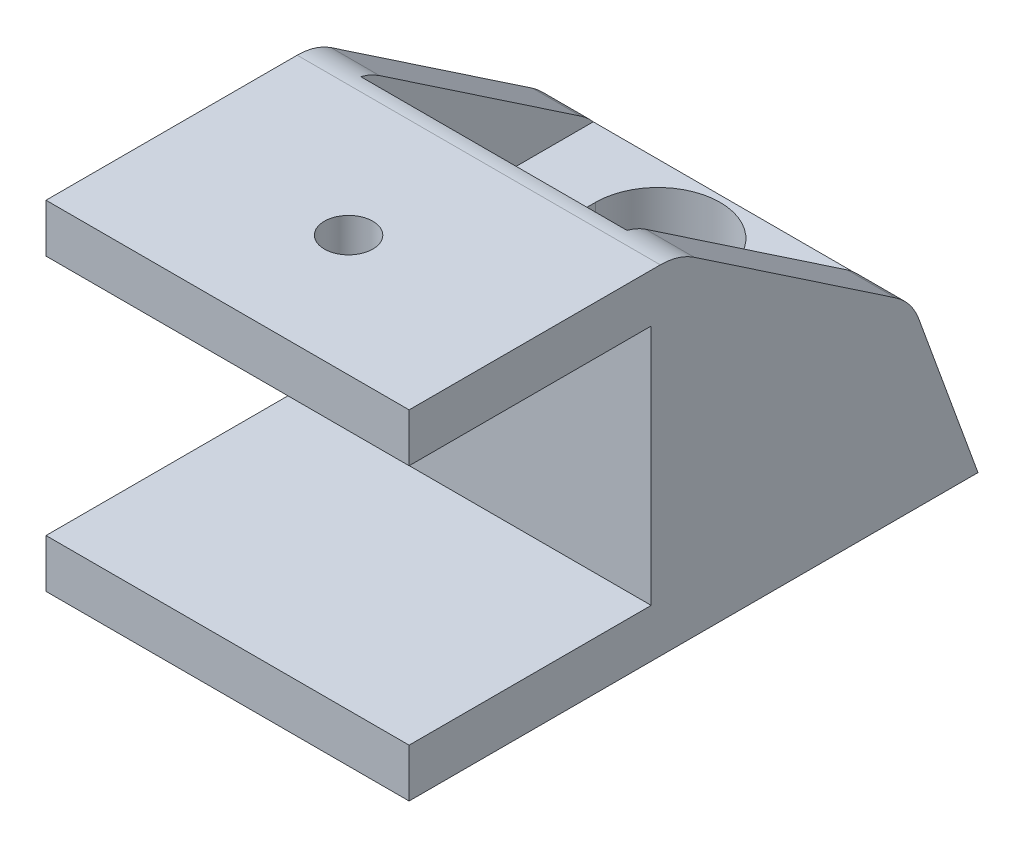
ISO-10303-21;
HEADER;
FILE_DESCRIPTION(('STEP AP214'),'2;1');
FILE_NAME('part.step','',(''),(''),'','','');
FILE_SCHEMA(('AUTOMOTIVE_DESIGN { 1 0 10303 214 1 1 1 1 }'));
ENDSEC;
DATA;
#1=APPLICATION_CONTEXT('core data for automotive mechanical design processes');
#2=APPLICATION_PROTOCOL_DEFINITION('international standard','automotive_design',2000,#1);
#3=PRODUCT_CONTEXT('',#1,'mechanical');
#4=PRODUCT('Part','Part','',(#3));
#5=PRODUCT_RELATED_PRODUCT_CATEGORY('part','',(#4));
#6=PRODUCT_DEFINITION_FORMATION('','',#4);
#7=PRODUCT_DEFINITION_CONTEXT('part definition',#1,'design');
#8=PRODUCT_DEFINITION('design','',#6,#7);
#9=PRODUCT_DEFINITION_SHAPE('','',#8);
#10=(LENGTH_UNIT() NAMED_UNIT(*) SI_UNIT(.MILLI.,.METRE.));
#11=(NAMED_UNIT(*) PLANE_ANGLE_UNIT() SI_UNIT($,.RADIAN.));
#12=(NAMED_UNIT(*) SI_UNIT($,.STERADIAN.) SOLID_ANGLE_UNIT());
#13=UNCERTAINTY_MEASURE_WITH_UNIT(LENGTH_MEASURE(1.E-05),#10,'distance_accuracy_value','');
#14=(GEOMETRIC_REPRESENTATION_CONTEXT(3) GLOBAL_UNCERTAINTY_ASSIGNED_CONTEXT((#13)) GLOBAL_UNIT_ASSIGNED_CONTEXT((#10,
#11,#12)) REPRESENTATION_CONTEXT('',''));
#15=CARTESIAN_POINT('',(0.,0.,0.));
#16=DIRECTION('',(0.,0.,1.));
#17=DIRECTION('',(1.,0.,0.));
#18=AXIS2_PLACEMENT_3D('',#15,#16,#17);
#19=CARTESIAN_POINT('',(-15.,0.,0.));
#20=DIRECTION('',(1.,0.,0.));
#21=DIRECTION('',(0.,0.,-1.));
#22=AXIS2_PLACEMENT_3D('',#19,#20,#21);
#23=PLANE('',#22);
#24=DIRECTION('',(0.,0.559192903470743,0.829037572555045));
#25=VECTOR('',#24,1.);
#26=CARTESIAN_POINT('',(-15.,11.,-4.72797334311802));
#27=LINE('',#26,#25);
#28=CARTESIAN_POINT('',(-15.,11.9084639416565,-3.38112016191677));
#29=VERTEX_POINT('',#28);
#30=CARTESIAN_POINT('',(-15.,23.1351878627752,13.2631825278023));
#31=VERTEX_POINT('',#30);
#32=EDGE_CURVE('E229',#29,#31,#27,.T.);
#33=ORIENTED_EDGE('',*,*,#32,.F.);
#34=CARTESIAN_POINT('',(-15.,7.76327607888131,-0.585155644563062));
#35=DIRECTION('',(1.,0.,0.));
#36=DIRECTION('',(0.,0.,-1.));
#37=AXIS2_PLACEMENT_3D('',#34,#35,#36);
#38=CIRCLE('',#37,5.);
#39=CARTESIAN_POINT('',(-15.,9.47337679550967,-5.2836187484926));
#40=VERTEX_POINT('',#39);
#41=EDGE_CURVE('E385',#29,#40,#38,.F.);
#42=ORIENTED_EDGE('',*,*,#41,.T.);
#43=DIRECTION('',(0.,0.939692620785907,0.342020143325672));
#44=VECTOR('',#43,1.);
#45=CARTESIAN_POINT('',(-15.,-4.00000000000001,-10.1875268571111));
#46=LINE('',#45,#44);
#47=CARTESIAN_POINT('',(-15.,-4.00000000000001,-10.1875268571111));
#48=VERTEX_POINT('',#47);
#49=EDGE_CURVE('E266',#48,#40,#46,.T.);
#50=ORIENTED_EDGE('',*,*,#49,.F.);
#51=DIRECTION('',(0.,0.,-1.));
#52=VECTOR('',#51,1.);
#53=CARTESIAN_POINT('',(-15.,-4.00000000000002,36.8124731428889));
#54=LINE('',#53,#52);
#55=CARTESIAN_POINT('',(-15.,-4.00000000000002,36.8124731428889));
#56=VERTEX_POINT('',#55);
#57=EDGE_CURVE('E311',#56,#48,#54,.T.);
#58=ORIENTED_EDGE('',*,*,#57,.F.);
#59=DIRECTION('',(0.,-1.,0.));
#60=VECTOR('',#59,1.);
#61=CARTESIAN_POINT('',(-15.,0.,36.8124731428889));
#62=LINE('',#61,#60);
#63=CARTESIAN_POINT('',(-15.,0.,36.8124731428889));
#64=VERTEX_POINT('',#63);
#65=EDGE_CURVE('E308',#64,#56,#62,.T.);
#66=ORIENTED_EDGE('',*,*,#65,.F.);
#67=DIRECTION('',(0.,0.,1.));
#68=VECTOR('',#67,1.);
#69=CARTESIAN_POINT('',(-15.,0.,16.8124731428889));
#70=LINE('',#69,#68);
#71=CARTESIAN_POINT('',(-15.,0.,16.8124731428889));
#72=VERTEX_POINT('',#71);
#73=EDGE_CURVE('E304',#72,#64,#70,.T.);
#74=ORIENTED_EDGE('',*,*,#73,.F.);
#75=DIRECTION('',(0.,-1.,0.));
#76=VECTOR('',#75,1.);
#77=CARTESIAN_POINT('',(-15.,19.99,16.8124731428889));
#78=LINE('',#77,#76);
#79=CARTESIAN_POINT('',(-15.,19.99,16.8124731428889));
#80=VERTEX_POINT('',#79);
#81=EDGE_CURVE('E305',#80,#72,#78,.T.);
#82=ORIENTED_EDGE('',*,*,#81,.F.);
#83=DIRECTION('',(0.,0.,-1.));
#84=VECTOR('',#83,1.);
#85=CARTESIAN_POINT('',(-15.,19.99,36.8124731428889));
#86=LINE('',#85,#84);
#87=CARTESIAN_POINT('',(-15.,19.99,36.8124731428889));
#88=VERTEX_POINT('',#87);
#89=EDGE_CURVE('E299',#88,#80,#86,.T.);
#90=ORIENTED_EDGE('',*,*,#89,.F.);
#91=DIRECTION('',(0.,-1.,0.));
#92=VECTOR('',#91,1.);
#93=CARTESIAN_POINT('',(-15.,23.99,36.8124731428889));
#94=LINE('',#93,#92);
#95=CARTESIAN_POINT('',(-15.,23.99,36.8124731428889));
#96=VERTEX_POINT('',#95);
#97=EDGE_CURVE('E298',#96,#88,#94,.T.);
#98=ORIENTED_EDGE('',*,*,#97,.F.);
#99=DIRECTION('',(0.,0.,1.));
#100=VECTOR('',#99,1.);
#101=CARTESIAN_POINT('',(-15.,23.99,0.));
#102=LINE('',#101,#100);
#103=CARTESIAN_POINT('',(-15.,23.99,16.059147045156));
#104=VERTEX_POINT('',#103);
#105=EDGE_CURVE('E291',#104,#96,#102,.T.);
#106=ORIENTED_EDGE('',*,*,#105,.F.);
#107=CARTESIAN_POINT('',(-15.,18.99,16.059147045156));
#108=DIRECTION('',(1.,0.,0.));
#109=DIRECTION('',(0.,0.,-1.));
#110=AXIS2_PLACEMENT_3D('',#107,#108,#109);
#111=CIRCLE('',#110,5.);
#112=EDGE_CURVE('E378',#104,#31,#111,.F.);
#113=ORIENTED_EDGE('',*,*,#112,.T.);
#114=EDGE_LOOP('',(#33,#42,#50,#58,#66,#74,#82,#90,#98,#106,#113));
#115=FACE_BOUND('',#114,.T.);
#116=ADVANCED_FACE('F44',(#115),#23,.F.);
#117=CARTESIAN_POINT('',(15.,-4.00000000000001,-10.1875268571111));
#118=DIRECTION('',(0.,-0.342020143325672,0.939692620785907));
#119=DIRECTION('',(0.,-0.939692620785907,-0.342020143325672));
#120=AXIS2_PLACEMENT_3D('',#117,#118,#119);
#121=PLANE('',#120);
#122=ORIENTED_EDGE('',*,*,#49,.T.);
#123=DIRECTION('',(-1.,0.,0.));
#124=VECTOR('',#123,1.);
#125=CARTESIAN_POINT('',(15.,9.47337679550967,-5.2836187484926));
#126=LINE('',#125,#124);
#127=CARTESIAN_POINT('',(15.,9.47337679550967,-5.2836187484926));
#128=VERTEX_POINT('',#127);
#129=EDGE_CURVE('E383',#40,#128,#126,.F.);
#130=ORIENTED_EDGE('',*,*,#129,.T.);
#131=DIRECTION('',(0.,0.939692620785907,0.342020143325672));
#132=VECTOR('',#131,1.);
#133=CARTESIAN_POINT('',(15.,-4.00000000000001,-10.1875268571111));
#134=LINE('',#133,#132);
#135=CARTESIAN_POINT('',(15.,-4.00000000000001,-10.1875268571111));
#136=VERTEX_POINT('',#135);
#137=EDGE_CURVE('E288',#136,#128,#134,.T.);
#138=ORIENTED_EDGE('',*,*,#137,.F.);
#139=DIRECTION('',(-1.,0.,0.));
#140=VECTOR('',#139,1.);
#141=CARTESIAN_POINT('',(15.,-4.00000000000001,-10.1875268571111));
#142=LINE('',#141,#140);
#143=EDGE_CURVE('E292',#136,#48,#142,.T.);
#144=ORIENTED_EDGE('',*,*,#143,.T.);
#145=EDGE_LOOP('',(#122,#130,#138,#144));
#146=FACE_BOUND('',#145,.T.);
#147=ADVANCED_FACE('F448',(#146),#121,.F.);
#148=CARTESIAN_POINT('',(15.,23.99,0.));
#149=DIRECTION('',(0.,-1.,0.));
#150=DIRECTION('',(0.,0.,-1.));
#151=AXIS2_PLACEMENT_3D('',#148,#149,#150);
#152=PLANE('',#151);
#153=CARTESIAN_POINT('',(0.,23.99,26.8124731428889));
#154=DIRECTION('',(0.,1.,0.));
#155=DIRECTION('',(0.,0.,1.));
#156=AXIS2_PLACEMENT_3D('',#153,#154,#155);
#157=CIRCLE('',#156,2.);
#158=CARTESIAN_POINT('',(0.,23.99,28.8124731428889));
#159=VERTEX_POINT('',#158);
#160=EDGE_CURVE('E257',#159,#159,#157,.T.);
#161=ORIENTED_EDGE('',*,*,#160,.F.);
#162=EDGE_LOOP('',(#161));
#163=FACE_BOUND('',#162,.T.);
#164=DIRECTION('',(0.,0.,1.));
#165=VECTOR('',#164,1.);
#166=CARTESIAN_POINT('',(15.,23.99,0.));
#167=LINE('',#166,#165);
#168=CARTESIAN_POINT('',(15.,23.99,16.059147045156));
#169=VERTEX_POINT('',#168);
#170=CARTESIAN_POINT('',(15.,23.99,36.8124731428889));
#171=VERTEX_POINT('',#170);
#172=EDGE_CURVE('E267',#169,#171,#167,.T.);
#173=ORIENTED_EDGE('',*,*,#172,.F.);
#174=DIRECTION('',(-1.,0.,0.));
#175=VECTOR('',#174,1.);
#176=CARTESIAN_POINT('',(15.,23.99,16.059147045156));
#177=LINE('',#176,#175);
#178=EDGE_CURVE('E53',#169,#104,#177,.T.);
#179=ORIENTED_EDGE('',*,*,#178,.T.);
#180=ORIENTED_EDGE('',*,*,#105,.T.);
#181=DIRECTION('',(-1.,0.,0.));
#182=VECTOR('',#181,1.);
#183=CARTESIAN_POINT('',(15.,23.99,36.8124731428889));
#184=LINE('',#183,#182);
#185=EDGE_CURVE('E338',#171,#96,#184,.T.);
#186=ORIENTED_EDGE('',*,*,#185,.F.);
#187=EDGE_LOOP('',(#173,#179,#180,#186));
#188=FACE_BOUND('',#187,.T.);
#189=ADVANCED_FACE('F399',(#163,#188),#152,.F.);
#190=CARTESIAN_POINT('',(15.,23.99,36.8124731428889));
#191=DIRECTION('',(0.,0.,-1.));
#192=DIRECTION('',(0.,1.,0.));
#193=AXIS2_PLACEMENT_3D('',#190,#191,#192);
#194=PLANE('',#193);
#195=ORIENTED_EDGE('',*,*,#97,.T.);
#196=DIRECTION('',(-1.,0.,0.));
#197=VECTOR('',#196,1.);
#198=CARTESIAN_POINT('',(15.,19.99,36.8124731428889));
#199=LINE('',#198,#197);
#200=CARTESIAN_POINT('',(15.,19.99,36.8124731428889));
#201=VERTEX_POINT('',#200);
#202=EDGE_CURVE('E337',#201,#88,#199,.T.);
#203=ORIENTED_EDGE('',*,*,#202,.F.);
#204=DIRECTION('',(0.,-1.,0.));
#205=VECTOR('',#204,1.);
#206=CARTESIAN_POINT('',(15.,23.99,36.8124731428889));
#207=LINE('',#206,#205);
#208=EDGE_CURVE('E269',#171,#201,#207,.T.);
#209=ORIENTED_EDGE('',*,*,#208,.F.);
#210=ORIENTED_EDGE('',*,*,#185,.T.);
#211=EDGE_LOOP('',(#195,#203,#209,#210));
#212=FACE_BOUND('',#211,.T.);
#213=ADVANCED_FACE('F412',(#212),#194,.F.);
#214=CARTESIAN_POINT('',(15.,19.99,36.8124731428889));
#215=DIRECTION('',(0.,1.,0.));
#216=DIRECTION('',(0.,0.,1.));
#217=AXIS2_PLACEMENT_3D('',#214,#215,#216);
#218=PLANE('',#217);
#219=CARTESIAN_POINT('',(0.,19.99,26.8124731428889));
#220=DIRECTION('',(0.,1.,0.));
#221=DIRECTION('',(0.,0.,1.));
#222=AXIS2_PLACEMENT_3D('',#219,#220,#221);
#223=CIRCLE('',#222,2.);
#224=CARTESIAN_POINT('',(0.,19.99,28.8124731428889));
#225=VERTEX_POINT('',#224);
#226=EDGE_CURVE('E261',#225,#225,#223,.T.);
#227=ORIENTED_EDGE('',*,*,#226,.T.);
#228=EDGE_LOOP('',(#227));
#229=FACE_BOUND('',#228,.T.);
#230=ORIENTED_EDGE('',*,*,#89,.T.);
#231=DIRECTION('',(-1.,0.,0.));
#232=VECTOR('',#231,1.);
#233=CARTESIAN_POINT('',(15.,19.99,16.8124731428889));
#234=LINE('',#233,#232);
#235=CARTESIAN_POINT('',(15.,19.99,16.8124731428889));
#236=VERTEX_POINT('',#235);
#237=EDGE_CURVE('E335',#236,#80,#234,.T.);
#238=ORIENTED_EDGE('',*,*,#237,.F.);
#239=DIRECTION('',(0.,0.,-1.));
#240=VECTOR('',#239,1.);
#241=CARTESIAN_POINT('',(15.,19.99,36.8124731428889));
#242=LINE('',#241,#240);
#243=EDGE_CURVE('E271',#201,#236,#242,.T.);
#244=ORIENTED_EDGE('',*,*,#243,.F.);
#245=ORIENTED_EDGE('',*,*,#202,.T.);
#246=EDGE_LOOP('',(#230,#238,#244,#245));
#247=FACE_BOUND('',#246,.T.);
#248=ADVANCED_FACE('F473',(#229,#247),#218,.F.);
#249=CARTESIAN_POINT('',(15.,19.99,16.8124731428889));
#250=DIRECTION('',(0.,0.,-1.));
#251=DIRECTION('',(0.,1.,0.));
#252=AXIS2_PLACEMENT_3D('',#249,#250,#251);
#253=PLANE('',#252);
#254=ORIENTED_EDGE('',*,*,#81,.T.);
#255=DIRECTION('',(-1.,0.,0.));
#256=VECTOR('',#255,1.);
#257=CARTESIAN_POINT('',(15.,0.,16.8124731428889));
#258=LINE('',#257,#256);
#259=CARTESIAN_POINT('',(15.,0.,16.8124731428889));
#260=VERTEX_POINT('',#259);
#261=EDGE_CURVE('E328',#260,#72,#258,.T.);
#262=ORIENTED_EDGE('',*,*,#261,.F.);
#263=DIRECTION('',(0.,-1.,0.));
#264=VECTOR('',#263,1.);
#265=CARTESIAN_POINT('',(15.,19.99,16.8124731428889));
#266=LINE('',#265,#264);
#267=EDGE_CURVE('E278',#236,#260,#266,.T.);
#268=ORIENTED_EDGE('',*,*,#267,.F.);
#269=ORIENTED_EDGE('',*,*,#237,.T.);
#270=EDGE_LOOP('',(#254,#262,#268,#269));
#271=FACE_BOUND('',#270,.T.);
#272=ADVANCED_FACE('F469',(#271),#253,.F.);
#273=CARTESIAN_POINT('',(15.,0.,16.8124731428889));
#274=DIRECTION('',(0.,-1.,0.));
#275=DIRECTION('',(0.,0.,-1.));
#276=AXIS2_PLACEMENT_3D('',#273,#274,#275);
#277=PLANE('',#276);
#278=ORIENTED_EDGE('',*,*,#73,.T.);
#279=DIRECTION('',(-1.,0.,0.));
#280=VECTOR('',#279,1.);
#281=CARTESIAN_POINT('',(15.,0.,36.8124731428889));
#282=LINE('',#281,#280);
#283=CARTESIAN_POINT('',(15.,0.,36.8124731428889));
#284=VERTEX_POINT('',#283);
#285=EDGE_CURVE('E325',#284,#64,#282,.T.);
#286=ORIENTED_EDGE('',*,*,#285,.F.);
#287=DIRECTION('',(0.,0.,1.));
#288=VECTOR('',#287,1.);
#289=CARTESIAN_POINT('',(15.,0.,16.8124731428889));
#290=LINE('',#289,#288);
#291=EDGE_CURVE('E280',#260,#284,#290,.T.);
#292=ORIENTED_EDGE('',*,*,#291,.F.);
#293=ORIENTED_EDGE('',*,*,#261,.T.);
#294=EDGE_LOOP('',(#278,#286,#292,#293));
#295=FACE_BOUND('',#294,.T.);
#296=ADVANCED_FACE('F461',(#295),#277,.F.);
#297=CARTESIAN_POINT('',(15.,0.,36.8124731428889));
#298=DIRECTION('',(0.,0.,-1.));
#299=DIRECTION('',(-1.,0.,0.));
#300=AXIS2_PLACEMENT_3D('',#297,#298,#299);
#301=PLANE('',#300);
#302=ORIENTED_EDGE('',*,*,#65,.T.);
#303=DIRECTION('',(-1.,0.,0.));
#304=VECTOR('',#303,1.);
#305=CARTESIAN_POINT('',(15.,-4.00000000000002,36.8124731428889));
#306=LINE('',#305,#304);
#307=CARTESIAN_POINT('',(15.,-4.00000000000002,36.8124731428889));
#308=VERTEX_POINT('',#307);
#309=EDGE_CURVE('E318',#308,#56,#306,.T.);
#310=ORIENTED_EDGE('',*,*,#309,.F.);
#311=DIRECTION('',(0.,-1.,0.));
#312=VECTOR('',#311,1.);
#313=CARTESIAN_POINT('',(15.,0.,36.8124731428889));
#314=LINE('',#313,#312);
#315=EDGE_CURVE('E285',#284,#308,#314,.T.);
#316=ORIENTED_EDGE('',*,*,#315,.F.);
#317=ORIENTED_EDGE('',*,*,#285,.T.);
#318=EDGE_LOOP('',(#302,#310,#316,#317));
#319=FACE_BOUND('',#318,.T.);
#320=ADVANCED_FACE('F456',(#319),#301,.F.);
#321=CARTESIAN_POINT('',(15.,-4.00000000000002,36.8124731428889));
#322=DIRECTION('',(0.,1.,0.));
#323=DIRECTION('',(0.,0.,1.));
#324=AXIS2_PLACEMENT_3D('',#321,#322,#323);
#325=PLANE('',#324);
#326=DIRECTION('',(0.,0.,1.));
#327=VECTOR('',#326,1.);
#328=CARTESIAN_POINT('',(-5.15,-4.00000000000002,36.8124731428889));
#329=LINE('',#328,#327);
#330=CARTESIAN_POINT('',(-5.15,-4.00000000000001,1.26838695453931));
#331=VERTEX_POINT('',#330);
#332=CARTESIAN_POINT('',(-5.15,-4.00000000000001,8.81247314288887));
#333=VERTEX_POINT('',#332);
#334=EDGE_CURVE('E225',#331,#333,#329,.T.);
#335=ORIENTED_EDGE('',*,*,#334,.T.);
#336=CARTESIAN_POINT('',(0.,-4.00000000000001,8.81247314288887));
#337=DIRECTION('',(0.,1.,0.));
#338=DIRECTION('',(0.,0.,1.));
#339=AXIS2_PLACEMENT_3D('',#336,#337,#338);
#340=CIRCLE('',#339,5.15);
#341=CARTESIAN_POINT('',(5.15,-4.00000000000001,8.81247314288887));
#342=VERTEX_POINT('',#341);
#343=EDGE_CURVE('E228',#333,#342,#340,.T.);
#344=ORIENTED_EDGE('',*,*,#343,.T.);
#345=DIRECTION('',(0.,0.,-1.));
#346=VECTOR('',#345,1.);
#347=CARTESIAN_POINT('',(5.15000000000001,-4.00000000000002,36.8124731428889));
#348=LINE('',#347,#346);
#349=CARTESIAN_POINT('',(5.15,-4.00000000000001,1.26838695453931));
#350=VERTEX_POINT('',#349);
#351=EDGE_CURVE('E212',#342,#350,#348,.T.);
#352=ORIENTED_EDGE('',*,*,#351,.T.);
#353=CARTESIAN_POINT('',(0.,-4.00000000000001,1.26838695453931));
#354=DIRECTION('',(0.,1.,0.));
#355=DIRECTION('',(0.,0.,1.));
#356=AXIS2_PLACEMENT_3D('',#353,#354,#355);
#357=CIRCLE('',#356,5.15);
#358=EDGE_CURVE('E189',#350,#331,#357,.T.);
#359=ORIENTED_EDGE('',*,*,#358,.T.);
#360=EDGE_LOOP('',(#335,#344,#352,#359));
#361=FACE_BOUND('',#360,.T.);
#362=ORIENTED_EDGE('',*,*,#57,.T.);
#363=ORIENTED_EDGE('',*,*,#143,.F.);
#364=DIRECTION('',(0.,0.,-1.));
#365=VECTOR('',#364,1.);
#366=CARTESIAN_POINT('',(15.,-4.00000000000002,36.8124731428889));
#367=LINE('',#366,#365);
#368=EDGE_CURVE('E281',#308,#136,#367,.T.);
#369=ORIENTED_EDGE('',*,*,#368,.F.);
#370=ORIENTED_EDGE('',*,*,#309,.T.);
#371=EDGE_LOOP('',(#362,#363,#369,#370));
#372=FACE_BOUND('',#371,.T.);
#373=ADVANCED_FACE('F451',(#361,#372),#325,.F.);
#374=CARTESIAN_POINT('',(15.,0.,0.));
#375=DIRECTION('',(1.,0.,0.));
#376=DIRECTION('',(0.,0.,-1.));
#377=AXIS2_PLACEMENT_3D('',#374,#375,#376);
#378=PLANE('',#377);
#379=ORIENTED_EDGE('',*,*,#137,.T.);
#380=CARTESIAN_POINT('',(15.,7.76327607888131,-0.585155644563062));
#381=DIRECTION('',(1.,0.,0.));
#382=DIRECTION('',(0.,0.,-1.));
#383=AXIS2_PLACEMENT_3D('',#380,#381,#382);
#384=CIRCLE('',#383,5.);
#385=CARTESIAN_POINT('',(15.,11.9084639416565,-3.38112016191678));
#386=VERTEX_POINT('',#385);
#387=EDGE_CURVE('E392',#128,#386,#384,.T.);
#388=ORIENTED_EDGE('',*,*,#387,.T.);
#389=DIRECTION('',(0.,-0.559192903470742,-0.829037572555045));
#390=VECTOR('',#389,1.);
#391=CARTESIAN_POINT('',(15.,9.75218653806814,-6.57793287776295));
#392=LINE('',#391,#390);
#393=CARTESIAN_POINT('',(15.,23.1351878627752,13.2631825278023));
#394=VERTEX_POINT('',#393);
#395=EDGE_CURVE('E238',#394,#386,#392,.T.);
#396=ORIENTED_EDGE('',*,*,#395,.F.);
#397=CARTESIAN_POINT('',(15.,18.99,16.059147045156));
#398=DIRECTION('',(1.,0.,0.));
#399=DIRECTION('',(0.,0.,-1.));
#400=AXIS2_PLACEMENT_3D('',#397,#398,#399);
#401=CIRCLE('',#400,5.);
#402=EDGE_CURVE('E387',#394,#169,#401,.T.);
#403=ORIENTED_EDGE('',*,*,#402,.T.);
#404=ORIENTED_EDGE('',*,*,#172,.T.);
#405=ORIENTED_EDGE('',*,*,#208,.T.);
#406=ORIENTED_EDGE('',*,*,#243,.T.);
#407=ORIENTED_EDGE('',*,*,#267,.T.);
#408=ORIENTED_EDGE('',*,*,#291,.T.);
#409=ORIENTED_EDGE('',*,*,#315,.T.);
#410=ORIENTED_EDGE('',*,*,#368,.T.);
#411=EDGE_LOOP('',(#379,#388,#396,#403,#404,#405,#406,#407,#408,#409,#410));
#412=FACE_BOUND('',#411,.T.);
#413=ADVANCED_FACE('F414',(#412),#378,.T.);
#414=CARTESIAN_POINT('',(0.,18.99,26.8124731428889));
#415=DIRECTION('',(0.,1.,0.));
#416=DIRECTION('',(0.,0.,1.));
#417=AXIS2_PLACEMENT_3D('',#414,#415,#416);
#418=CYLINDRICAL_SURFACE('',#417,2.);
#419=ORIENTED_EDGE('',*,*,#160,.T.);
#420=EDGE_LOOP('',(#419));
#421=FACE_BOUND('',#420,.T.);
#422=ORIENTED_EDGE('',*,*,#226,.F.);
#423=EDGE_LOOP('',(#422));
#424=FACE_BOUND('',#423,.T.);
#425=ADVANCED_FACE('F524',(#421,#424),#418,.F.);
#426=CARTESIAN_POINT('',(11.,10.99,-15.1875268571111));
#427=DIRECTION('',(1.,0.,0.));
#428=DIRECTION('',(0.,0.,-1.));
#429=AXIS2_PLACEMENT_3D('',#426,#427,#428);
#430=PLANE('',#429);
#431=DIRECTION('',(0.,-0.559192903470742,-0.829037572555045));
#432=VECTOR('',#431,1.);
#433=CARTESIAN_POINT('',(11.,6.14790846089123,-11.9214948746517));
#434=LINE('',#433,#432);
#435=CARTESIAN_POINT('',(11.,23.1351878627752,13.2631825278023));
#436=VERTEX_POINT('',#435);
#437=CARTESIAN_POINT('',(11.,11.9084639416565,-3.38112016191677));
#438=VERTEX_POINT('',#437);
#439=EDGE_CURVE('E234',#436,#438,#434,.T.);
#440=ORIENTED_EDGE('',*,*,#439,.T.);
#441=CARTESIAN_POINT('',(11.,7.76327607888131,-0.585155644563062));
#442=DIRECTION('',(1.,0.,0.));
#443=DIRECTION('',(0.,0.,-1.));
#444=AXIS2_PLACEMENT_3D('',#441,#442,#443);
#445=CIRCLE('',#444,5.);
#446=CARTESIAN_POINT('',(11.,10.99,-4.40461277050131));
#447=VERTEX_POINT('',#446);
#448=EDGE_CURVE('E363',#438,#447,#445,.F.);
#449=ORIENTED_EDGE('',*,*,#448,.T.);
#450=DIRECTION('',(0.,0.,-1.));
#451=VECTOR('',#450,1.);
#452=CARTESIAN_POINT('',(11.,10.99,14.8124731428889));
#453=LINE('',#452,#451);
#454=CARTESIAN_POINT('',(11.,10.99,14.8124731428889));
#455=VERTEX_POINT('',#454);
#456=EDGE_CURVE('E248',#455,#447,#453,.T.);
#457=ORIENTED_EDGE('',*,*,#456,.F.);
#458=DIRECTION('',(0.,1.,0.));
#459=VECTOR('',#458,1.);
#460=CARTESIAN_POINT('',(11.,10.99,14.8124731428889));
#461=LINE('',#460,#459);
#462=CARTESIAN_POINT('',(11.,23.8320867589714,14.8124731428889));
#463=VERTEX_POINT('',#462);
#464=EDGE_CURVE('E251',#455,#463,#461,.T.);
#465=ORIENTED_EDGE('',*,*,#464,.T.);
#466=CARTESIAN_POINT('',(11.,18.99,16.059147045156));
#467=DIRECTION('',(1.,0.,0.));
#468=DIRECTION('',(0.,0.,-1.));
#469=AXIS2_PLACEMENT_3D('',#466,#467,#468);
#470=CIRCLE('',#469,5.);
#471=EDGE_CURVE('E356',#463,#436,#470,.F.);
#472=ORIENTED_EDGE('',*,*,#471,.T.);
#473=EDGE_LOOP('',(#440,#449,#457,#465,#472));
#474=FACE_BOUND('',#473,.T.);
#475=ADVANCED_FACE('F424',(#474),#430,.F.);
#476=CARTESIAN_POINT('',(-11.,10.99,-10.1875268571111));
#477=DIRECTION('',(-1.,0.,0.));
#478=DIRECTION('',(0.,0.,1.));
#479=AXIS2_PLACEMENT_3D('',#476,#477,#478);
#480=PLANE('',#479);
#481=DIRECTION('',(0.,0.,1.));
#482=VECTOR('',#481,1.);
#483=CARTESIAN_POINT('',(-11.,10.99,-10.1875268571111));
#484=LINE('',#483,#482);
#485=CARTESIAN_POINT('',(-11.,10.99,-4.40461277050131));
#486=VERTEX_POINT('',#485);
#487=CARTESIAN_POINT('',(-11.,10.99,14.8124731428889));
#488=VERTEX_POINT('',#487);
#489=EDGE_CURVE('E245',#486,#488,#484,.T.);
#490=ORIENTED_EDGE('',*,*,#489,.F.);
#491=CARTESIAN_POINT('',(-11.,7.76327607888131,-0.585155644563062));
#492=DIRECTION('',(-1.,0.,0.));
#493=DIRECTION('',(0.,0.,1.));
#494=AXIS2_PLACEMENT_3D('',#491,#492,#493);
#495=CIRCLE('',#494,5.);
#496=CARTESIAN_POINT('',(-11.,11.9084639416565,-3.38112016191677));
#497=VERTEX_POINT('',#496);
#498=EDGE_CURVE('E369',#486,#497,#495,.F.);
#499=ORIENTED_EDGE('',*,*,#498,.T.);
#500=DIRECTION('',(0.,0.559192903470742,0.829037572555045));
#501=VECTOR('',#500,1.);
#502=CARTESIAN_POINT('',(-11.,8.46586809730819,-8.48497839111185));
#503=LINE('',#502,#501);
#504=CARTESIAN_POINT('',(-11.,23.1351878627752,13.2631825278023));
#505=VERTEX_POINT('',#504);
#506=EDGE_CURVE('E345',#497,#505,#503,.T.);
#507=ORIENTED_EDGE('',*,*,#506,.T.);
#508=CARTESIAN_POINT('',(-11.,18.99,16.059147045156));
#509=DIRECTION('',(-1.,0.,0.));
#510=DIRECTION('',(0.,0.,1.));
#511=AXIS2_PLACEMENT_3D('',#508,#509,#510);
#512=CIRCLE('',#511,5.);
#513=CARTESIAN_POINT('',(-11.,23.8320867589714,14.8124731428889));
#514=VERTEX_POINT('',#513);
#515=EDGE_CURVE('E370',#505,#514,#512,.F.);
#516=ORIENTED_EDGE('',*,*,#515,.T.);
#517=DIRECTION('',(0.,1.,0.));
#518=VECTOR('',#517,1.);
#519=CARTESIAN_POINT('',(-11.,10.99,14.8124731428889));
#520=LINE('',#519,#518);
#521=EDGE_CURVE('E254',#488,#514,#520,.T.);
#522=ORIENTED_EDGE('',*,*,#521,.F.);
#523=EDGE_LOOP('',(#490,#499,#507,#516,#522));
#524=FACE_BOUND('',#523,.T.);
#525=ADVANCED_FACE('F434',(#524),#480,.F.);
#526=CARTESIAN_POINT('',(0.,10.99,0.));
#527=DIRECTION('',(0.,-1.,0.));
#528=DIRECTION('',(0.,0.,-1.));
#529=AXIS2_PLACEMENT_3D('',#526,#527,#528);
#530=PLANE('',#529);
#531=DIRECTION('',(0.,0.,-1.));
#532=VECTOR('',#531,1.);
#533=CARTESIAN_POINT('',(5.15,10.99,8.81247314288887));
#534=LINE('',#533,#532);
#535=CARTESIAN_POINT('',(5.15,10.99,8.81247314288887));
#536=VERTEX_POINT('',#535);
#537=CARTESIAN_POINT('',(5.15,10.99,1.26838695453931));
#538=VERTEX_POINT('',#537);
#539=EDGE_CURVE('E191',#536,#538,#534,.T.);
#540=ORIENTED_EDGE('',*,*,#539,.F.);
#541=CARTESIAN_POINT('',(0.,10.99,8.81247314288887));
#542=DIRECTION('',(0.,1.,0.));
#543=DIRECTION('',(0.,0.,1.));
#544=AXIS2_PLACEMENT_3D('',#541,#542,#543);
#545=CIRCLE('',#544,5.15);
#546=CARTESIAN_POINT('',(-5.15,10.99,8.81247314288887));
#547=VERTEX_POINT('',#546);
#548=EDGE_CURVE('E69',#547,#536,#545,.T.);
#549=ORIENTED_EDGE('',*,*,#548,.F.);
#550=DIRECTION('',(0.,0.,1.));
#551=VECTOR('',#550,1.);
#552=CARTESIAN_POINT('',(-5.15,10.99,8.81247314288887));
#553=LINE('',#552,#551);
#554=CARTESIAN_POINT('',(-5.15,10.99,1.26838695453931));
#555=VERTEX_POINT('',#554);
#556=EDGE_CURVE('E203',#555,#547,#553,.T.);
#557=ORIENTED_EDGE('',*,*,#556,.F.);
#558=CARTESIAN_POINT('',(0.,10.99,1.26838695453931));
#559=DIRECTION('',(0.,1.,0.));
#560=DIRECTION('',(0.,0.,1.));
#561=AXIS2_PLACEMENT_3D('',#558,#559,#560);
#562=CIRCLE('',#561,5.15);
#563=EDGE_CURVE('E184',#538,#555,#562,.T.);
#564=ORIENTED_EDGE('',*,*,#563,.F.);
#565=EDGE_LOOP('',(#540,#549,#557,#564));
#566=FACE_BOUND('',#565,.T.);
#567=ORIENTED_EDGE('',*,*,#456,.T.);
#568=DIRECTION('',(-1.,0.,0.));
#569=VECTOR('',#568,1.);
#570=CARTESIAN_POINT('',(11.,10.99,-4.40461277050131));
#571=LINE('',#570,#569);
#572=EDGE_CURVE('E364',#447,#486,#571,.T.);
#573=ORIENTED_EDGE('',*,*,#572,.T.);
#574=ORIENTED_EDGE('',*,*,#489,.T.);
#575=DIRECTION('',(1.,0.,0.));
#576=VECTOR('',#575,1.);
#577=CARTESIAN_POINT('',(-11.,10.99,14.8124731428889));
#578=LINE('',#577,#576);
#579=EDGE_CURVE('E244',#488,#455,#578,.T.);
#580=ORIENTED_EDGE('',*,*,#579,.T.);
#581=EDGE_LOOP('',(#567,#573,#574,#580));
#582=FACE_BOUND('',#581,.T.);
#583=ADVANCED_FACE('F196',(#566,#582),#530,.F.);
#584=CARTESIAN_POINT('',(-11.,10.99,14.8124731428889));
#585=DIRECTION('',(0.,0.,1.));
#586=DIRECTION('',(0.,-1.,0.));
#587=AXIS2_PLACEMENT_3D('',#584,#585,#586);
#588=PLANE('',#587);
#589=ORIENTED_EDGE('',*,*,#521,.T.);
#590=DIRECTION('',(-1.,0.,0.));
#591=VECTOR('',#590,1.);
#592=CARTESIAN_POINT('',(-11.,23.8320867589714,14.8124731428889));
#593=LINE('',#592,#591);
#594=EDGE_CURVE('E11',#514,#463,#593,.F.);
#595=ORIENTED_EDGE('',*,*,#594,.T.);
#596=ORIENTED_EDGE('',*,*,#464,.F.);
#597=ORIENTED_EDGE('',*,*,#579,.F.);
#598=EDGE_LOOP('',(#589,#595,#596,#597));
#599=FACE_BOUND('',#598,.T.);
#600=ADVANCED_FACE('F429',(#599),#588,.F.);
#601=CARTESIAN_POINT('',(30.,11.,-4.72797334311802));
#602=DIRECTION('',(0.,-0.829037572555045,0.559192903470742));
#603=DIRECTION('',(0.,-0.559192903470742,-0.829037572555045));
#604=AXIS2_PLACEMENT_3D('',#601,#602,#603);
#605=PLANE('',#604);
#606=ORIENTED_EDGE('',*,*,#506,.F.);
#607=DIRECTION('',(-1.,0.,0.));
#608=VECTOR('',#607,1.);
#609=CARTESIAN_POINT('',(-13.,11.9084639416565,-3.38112016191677));
#610=LINE('',#609,#608);
#611=EDGE_CURVE('E376',#497,#29,#610,.T.);
#612=ORIENTED_EDGE('',*,*,#611,.T.);
#613=ORIENTED_EDGE('',*,*,#32,.T.);
#614=DIRECTION('',(-1.,0.,0.));
#615=VECTOR('',#614,1.);
#616=CARTESIAN_POINT('',(-13.,23.1351878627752,13.2631825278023));
#617=LINE('',#616,#615);
#618=EDGE_CURVE('E373',#31,#505,#617,.F.);
#619=ORIENTED_EDGE('',*,*,#618,.T.);
#620=EDGE_LOOP('',(#606,#612,#613,#619));
#621=FACE_BOUND('',#620,.T.);
#622=ADVANCED_FACE('F439',(#621),#605,.F.);
#623=ORIENTED_EDGE('',*,*,#395,.T.);
#624=DIRECTION('',(-1.,0.,0.));
#625=VECTOR('',#624,1.);
#626=CARTESIAN_POINT('',(30.,11.9084639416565,-3.38112016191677));
#627=LINE('',#626,#625);
#628=EDGE_CURVE('E354',#386,#438,#627,.T.);
#629=ORIENTED_EDGE('',*,*,#628,.T.);
#630=ORIENTED_EDGE('',*,*,#439,.F.);
#631=DIRECTION('',(-1.,0.,0.));
#632=VECTOR('',#631,1.);
#633=CARTESIAN_POINT('',(30.,23.1351878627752,13.2631825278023));
#634=LINE('',#633,#632);
#635=EDGE_CURVE('E352',#436,#394,#634,.F.);
#636=ORIENTED_EDGE('',*,*,#635,.T.);
#637=EDGE_LOOP('',(#623,#629,#630,#636));
#638=FACE_BOUND('',#637,.T.);
#639=ADVANCED_FACE('F422',(#638),#605,.F.);
#640=CARTESIAN_POINT('',(30.,7.76327607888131,-0.585155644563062));
#641=DIRECTION('',(-1.,0.,0.));
#642=DIRECTION('',(0.,0.,1.));
#643=AXIS2_PLACEMENT_3D('',#640,#641,#642);
#644=CYLINDRICAL_SURFACE('',#643,5.);
#645=ORIENTED_EDGE('',*,*,#387,.F.);
#646=ORIENTED_EDGE('',*,*,#129,.F.);
#647=ORIENTED_EDGE('',*,*,#41,.F.);
#648=ORIENTED_EDGE('',*,*,#611,.F.);
#649=ORIENTED_EDGE('',*,*,#498,.F.);
#650=ORIENTED_EDGE('',*,*,#572,.F.);
#651=ORIENTED_EDGE('',*,*,#448,.F.);
#652=ORIENTED_EDGE('',*,*,#628,.F.);
#653=EDGE_LOOP('',(#645,#646,#647,#648,#649,#650,#651,#652));
#654=FACE_BOUND('',#653,.T.);
#655=ADVANCED_FACE('F443',(#654),#644,.T.);
#656=CARTESIAN_POINT('',(15.,18.99,16.059147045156));
#657=DIRECTION('',(-1.,0.,0.));
#658=DIRECTION('',(0.,0.,1.));
#659=AXIS2_PLACEMENT_3D('',#656,#657,#658);
#660=CYLINDRICAL_SURFACE('',#659,5.);
#661=ORIENTED_EDGE('',*,*,#402,.F.);
#662=ORIENTED_EDGE('',*,*,#635,.F.);
#663=ORIENTED_EDGE('',*,*,#471,.F.);
#664=ORIENTED_EDGE('',*,*,#594,.F.);
#665=ORIENTED_EDGE('',*,*,#515,.F.);
#666=ORIENTED_EDGE('',*,*,#618,.F.);
#667=ORIENTED_EDGE('',*,*,#112,.F.);
#668=ORIENTED_EDGE('',*,*,#178,.F.);
#669=EDGE_LOOP('',(#661,#662,#663,#664,#665,#666,#667,#668));
#670=FACE_BOUND('',#669,.T.);
#671=ADVANCED_FACE('F50',(#670),#660,.T.);
#672=CARTESIAN_POINT('',(0.,-9.01,8.81247314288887));
#673=DIRECTION('',(0.,1.,0.));
#674=DIRECTION('',(0.,0.,1.));
#675=AXIS2_PLACEMENT_3D('',#672,#673,#674);
#676=CYLINDRICAL_SURFACE('',#675,5.15);
#677=DIRECTION('',(0.,1.,0.));
#678=VECTOR('',#677,1.);
#679=CARTESIAN_POINT('',(-5.15,-9.01,8.81247314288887));
#680=LINE('',#679,#678);
#681=EDGE_CURVE('E208',#333,#547,#680,.T.);
#682=ORIENTED_EDGE('',*,*,#681,.T.);
#683=ORIENTED_EDGE('',*,*,#548,.T.);
#684=DIRECTION('',(0.,1.,0.));
#685=VECTOR('',#684,1.);
#686=CARTESIAN_POINT('',(5.15,-9.01,8.81247314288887));
#687=LINE('',#686,#685);
#688=EDGE_CURVE('E194',#342,#536,#687,.T.);
#689=ORIENTED_EDGE('',*,*,#688,.F.);
#690=ORIENTED_EDGE('',*,*,#343,.F.);
#691=EDGE_LOOP('',(#682,#683,#689,#690));
#692=FACE_BOUND('',#691,.T.);
#693=ADVANCED_FACE('F618',(#692),#676,.F.);
#694=CARTESIAN_POINT('',(-5.15,-9.01,8.81247314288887));
#695=DIRECTION('',(-1.,0.,0.));
#696=DIRECTION('',(0.,0.,1.));
#697=AXIS2_PLACEMENT_3D('',#694,#695,#696);
#698=PLANE('',#697);
#699=DIRECTION('',(0.,1.,0.));
#700=VECTOR('',#699,1.);
#701=CARTESIAN_POINT('',(-5.15,-9.01,1.26838695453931));
#702=LINE('',#701,#700);
#703=EDGE_CURVE('E193',#331,#555,#702,.T.);
#704=ORIENTED_EDGE('',*,*,#703,.T.);
#705=ORIENTED_EDGE('',*,*,#556,.T.);
#706=ORIENTED_EDGE('',*,*,#681,.F.);
#707=ORIENTED_EDGE('',*,*,#334,.F.);
#708=EDGE_LOOP('',(#704,#705,#706,#707));
#709=FACE_BOUND('',#708,.T.);
#710=ADVANCED_FACE('F621',(#709),#698,.F.);
#711=CARTESIAN_POINT('',(0.,-9.01,1.26838695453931));
#712=DIRECTION('',(0.,1.,0.));
#713=DIRECTION('',(0.,0.,1.));
#714=AXIS2_PLACEMENT_3D('',#711,#712,#713);
#715=CYLINDRICAL_SURFACE('',#714,5.15);
#716=DIRECTION('',(0.,1.,0.));
#717=VECTOR('',#716,1.);
#718=CARTESIAN_POINT('',(5.15,-9.01,1.26838695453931));
#719=LINE('',#718,#717);
#720=EDGE_CURVE('E63',#350,#538,#719,.T.);
#721=ORIENTED_EDGE('',*,*,#720,.T.);
#722=ORIENTED_EDGE('',*,*,#563,.T.);
#723=ORIENTED_EDGE('',*,*,#703,.F.);
#724=ORIENTED_EDGE('',*,*,#358,.F.);
#725=EDGE_LOOP('',(#721,#722,#723,#724));
#726=FACE_BOUND('',#725,.T.);
#727=ADVANCED_FACE('F185',(#726),#715,.F.);
#728=CARTESIAN_POINT('',(5.15,-9.01,8.81247314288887));
#729=DIRECTION('',(1.,0.,0.));
#730=DIRECTION('',(0.,0.,-1.));
#731=AXIS2_PLACEMENT_3D('',#728,#729,#730);
#732=PLANE('',#731);
#733=ORIENTED_EDGE('',*,*,#688,.T.);
#734=ORIENTED_EDGE('',*,*,#539,.T.);
#735=ORIENTED_EDGE('',*,*,#720,.F.);
#736=ORIENTED_EDGE('',*,*,#351,.F.);
#737=EDGE_LOOP('',(#733,#734,#735,#736));
#738=FACE_BOUND('',#737,.T.);
#739=ADVANCED_FACE('F197',(#738),#732,.F.);
#740=CLOSED_SHELL('',(#116,#147,#189,#213,#248,#272,#296,#320,#373,#413,#425,#475,#525,#583,
#600,#622,#639,#655,#671,#693,#710,#727,#739));
#741=MANIFOLD_SOLID_BREP('B2',#740);
#742=ADVANCED_BREP_SHAPE_REPRESENTATION('',(#18,#741),#14);
#743=SHAPE_DEFINITION_REPRESENTATION(#9,#742);
ENDSEC;
END-ISO-10303-21;
